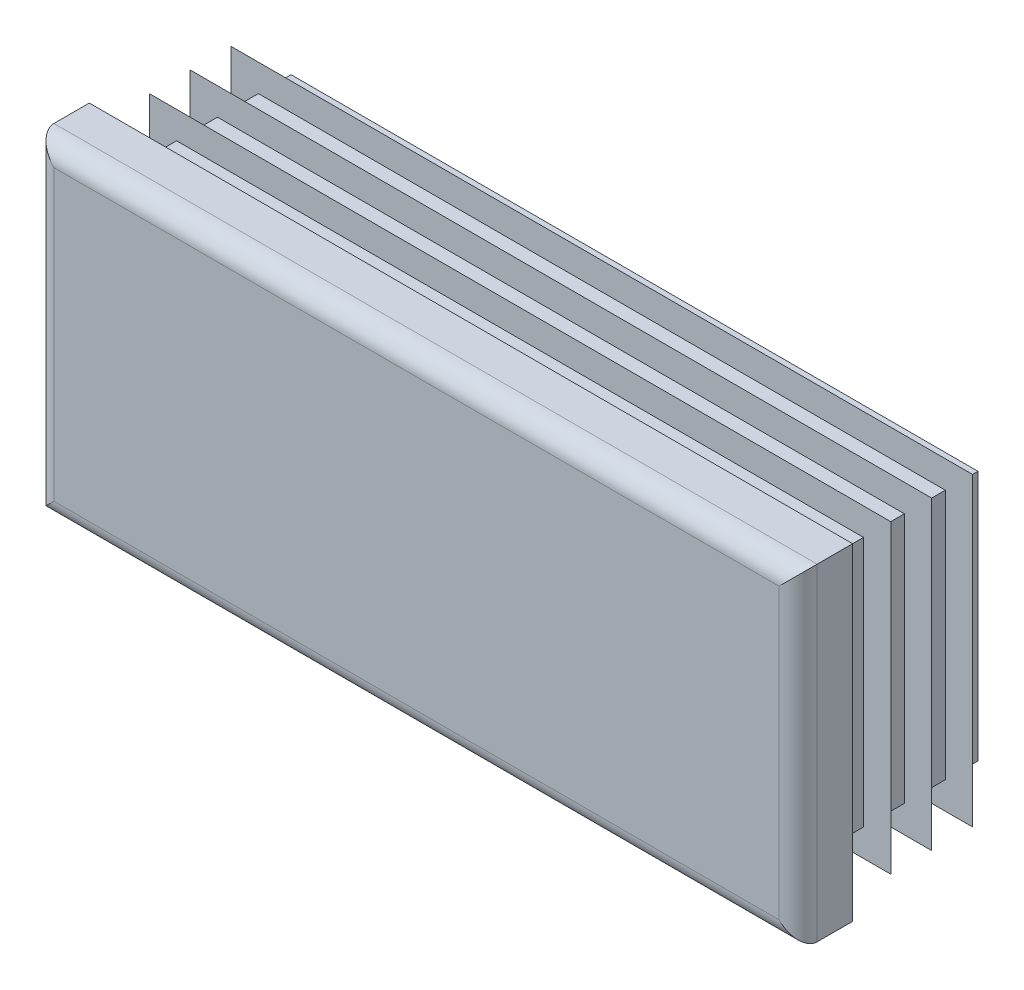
ISO-10303-21;
HEADER;
FILE_DESCRIPTION(('STEP AP214'),'2;1');
FILE_NAME('part.step','',(''),(''),'','','');
FILE_SCHEMA(('AUTOMOTIVE_DESIGN { 1 0 10303 214 1 1 1 1 }'));
ENDSEC;
DATA;
#1=APPLICATION_CONTEXT('core data for automotive mechanical design processes');
#2=APPLICATION_PROTOCOL_DEFINITION('international standard','automotive_design',2000,#1);
#3=PRODUCT_CONTEXT('',#1,'mechanical');
#4=PRODUCT('Part','Part','',(#3));
#5=PRODUCT_RELATED_PRODUCT_CATEGORY('part','',(#4));
#6=PRODUCT_DEFINITION_FORMATION('','',#4);
#7=PRODUCT_DEFINITION_CONTEXT('part definition',#1,'design');
#8=PRODUCT_DEFINITION('design','',#6,#7);
#9=PRODUCT_DEFINITION_SHAPE('','',#8);
#10=(LENGTH_UNIT() NAMED_UNIT(*) SI_UNIT(.MILLI.,.METRE.));
#11=(NAMED_UNIT(*) PLANE_ANGLE_UNIT() SI_UNIT($,.RADIAN.));
#12=(NAMED_UNIT(*) SI_UNIT($,.STERADIAN.) SOLID_ANGLE_UNIT());
#13=UNCERTAINTY_MEASURE_WITH_UNIT(LENGTH_MEASURE(1.E-05),#10,'distance_accuracy_value','');
#14=(GEOMETRIC_REPRESENTATION_CONTEXT(3) GLOBAL_UNCERTAINTY_ASSIGNED_CONTEXT((#13)) GLOBAL_UNIT_ASSIGNED_CONTEXT((#10,
#11,#12)) REPRESENTATION_CONTEXT('',''));
#15=CARTESIAN_POINT('',(0.,0.,0.));
#16=DIRECTION('',(0.,0.,1.));
#17=DIRECTION('',(1.,0.,0.));
#18=AXIS2_PLACEMENT_3D('',#15,#16,#17);
#19=CARTESIAN_POINT('',(33.25,-15.,5.));
#20=DIRECTION('',(0.,0.,-1.));
#21=DIRECTION('',(0.,1.,0.));
#22=AXIS2_PLACEMENT_3D('',#19,#20,#21);
#23=PLANE('',#22);
#24=DIRECTION('',(0.,1.,0.));
#25=VECTOR('',#24,1.);
#26=CARTESIAN_POINT('',(-33.25,-15.,5.));
#27=LINE('',#26,#25);
#28=CARTESIAN_POINT('',(-33.25,-13.25,5.));
#29=VERTEX_POINT('',#28);
#30=CARTESIAN_POINT('',(-33.25,13.25,5.));
#31=VERTEX_POINT('',#30);
#32=EDGE_CURVE('E310',#29,#31,#27,.T.);
#33=ORIENTED_EDGE('',*,*,#32,.F.);
#34=DIRECTION('',(-1.,0.,0.));
#35=VECTOR('',#34,1.);
#36=CARTESIAN_POINT('',(35.,-13.25,5.));
#37=LINE('',#36,#35);
#38=CARTESIAN_POINT('',(33.25,-13.25,5.));
#39=VERTEX_POINT('',#38);
#40=EDGE_CURVE('E482',#39,#29,#37,.T.);
#41=ORIENTED_EDGE('',*,*,#40,.F.);
#42=DIRECTION('',(0.,1.,0.));
#43=VECTOR('',#42,1.);
#44=CARTESIAN_POINT('',(33.25,-15.,5.));
#45=LINE('',#44,#43);
#46=CARTESIAN_POINT('',(33.25,13.25,5.));
#47=VERTEX_POINT('',#46);
#48=EDGE_CURVE('E305',#39,#47,#45,.T.);
#49=ORIENTED_EDGE('',*,*,#48,.T.);
#50=DIRECTION('',(-1.,0.,0.));
#51=VECTOR('',#50,1.);
#52=CARTESIAN_POINT('',(35.,13.25,5.));
#53=LINE('',#52,#51);
#54=EDGE_CURVE('E630',#47,#31,#53,.T.);
#55=ORIENTED_EDGE('',*,*,#54,.T.);
#56=EDGE_LOOP('',(#33,#41,#49,#55));
#57=FACE_BOUND('',#56,.T.);
#58=ADVANCED_FACE('F14',(#57),#23,.F.);
#59=CARTESIAN_POINT('',(-33.25,-15.,3.25));
#60=DIRECTION('',(0.,1.,0.));
#61=DIRECTION('',(-1.,0.,0.));
#62=AXIS2_PLACEMENT_3D('',#59,#60,#61);
#63=CYLINDRICAL_SURFACE('',#62,1.75);
#64=DIRECTION('',(0.,1.,0.));
#65=VECTOR('',#64,1.);
#66=CARTESIAN_POINT('',(-35.,-15.,3.25));
#67=LINE('',#66,#65);
#68=CARTESIAN_POINT('',(-35.,-15.,3.25));
#69=VERTEX_POINT('',#68);
#70=CARTESIAN_POINT('',(-35.,15.,3.25));
#71=VERTEX_POINT('',#70);
#72=EDGE_CURVE('E402',#69,#71,#67,.T.);
#73=ORIENTED_EDGE('',*,*,#72,.F.);
#74=CARTESIAN_POINT('',(-33.25,-13.25,3.25));
#75=DIRECTION('',(-0.707106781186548,0.707106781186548,0.));
#76=DIRECTION('',(0.707106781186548,0.707106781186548,0.));
#77=AXIS2_PLACEMENT_3D('',#74,#75,#76);
#78=ELLIPSE('',#77,2.47487373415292,1.75);
#79=EDGE_CURVE('E59',#69,#29,#78,.T.);
#80=ORIENTED_EDGE('',*,*,#79,.T.);
#81=ORIENTED_EDGE('',*,*,#32,.T.);
#82=CARTESIAN_POINT('',(-33.25,13.25,3.25));
#83=DIRECTION('',(0.707106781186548,0.707106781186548,0.));
#84=DIRECTION('',(-0.707106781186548,0.707106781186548,0.));
#85=AXIS2_PLACEMENT_3D('',#82,#83,#84);
#86=ELLIPSE('',#85,2.47487373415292,1.75);
#87=EDGE_CURVE('E306',#31,#71,#86,.F.);
#88=ORIENTED_EDGE('',*,*,#87,.T.);
#89=EDGE_LOOP('',(#73,#80,#81,#88));
#90=FACE_BOUND('',#89,.T.);
#91=ADVANCED_FACE('F16',(#90),#63,.T.);
#92=CARTESIAN_POINT('',(-35.,-15.,3.25));
#93=DIRECTION('',(1.,0.,0.));
#94=DIRECTION('',(0.,1.,0.));
#95=AXIS2_PLACEMENT_3D('',#92,#93,#94);
#96=PLANE('',#95);
#97=DIRECTION('',(0.,0.,-1.));
#98=VECTOR('',#97,1.);
#99=CARTESIAN_POINT('',(-35.,15.,3.25));
#100=LINE('',#99,#98);
#101=CARTESIAN_POINT('',(-35.,15.,0.));
#102=VERTEX_POINT('',#101);
#103=EDGE_CURVE('E615',#71,#102,#100,.T.);
#104=ORIENTED_EDGE('',*,*,#103,.T.);
#105=DIRECTION('',(0.,1.,0.));
#106=VECTOR('',#105,1.);
#107=CARTESIAN_POINT('',(-35.,-15.,0.));
#108=LINE('',#107,#106);
#109=CARTESIAN_POINT('',(-35.,-15.,0.));
#110=VERTEX_POINT('',#109);
#111=EDGE_CURVE('E400',#110,#102,#108,.T.);
#112=ORIENTED_EDGE('',*,*,#111,.F.);
#113=DIRECTION('',(0.,0.,-1.));
#114=VECTOR('',#113,1.);
#115=CARTESIAN_POINT('',(-35.,-15.,3.25));
#116=LINE('',#115,#114);
#117=EDGE_CURVE('E616',#69,#110,#116,.T.);
#118=ORIENTED_EDGE('',*,*,#117,.F.);
#119=ORIENTED_EDGE('',*,*,#72,.T.);
#120=EDGE_LOOP('',(#104,#112,#118,#119));
#121=FACE_BOUND('',#120,.T.);
#122=ADVANCED_FACE('F697',(#121),#96,.F.);
#123=CARTESIAN_POINT('',(-31.5,-15.,0.));
#124=DIRECTION('',(1.,0.,0.));
#125=DIRECTION('',(0.,1.,0.));
#126=AXIS2_PLACEMENT_3D('',#123,#124,#125);
#127=PLANE('',#126);
#128=DIRECTION('',(0.,1.,0.));
#129=VECTOR('',#128,1.);
#130=CARTESIAN_POINT('',(-31.5,-15.,0.));
#131=LINE('',#130,#129);
#132=CARTESIAN_POINT('',(-31.5,-11.5,0.));
#133=VERTEX_POINT('',#132);
#134=CARTESIAN_POINT('',(-31.5,11.5,0.));
#135=VERTEX_POINT('',#134);
#136=EDGE_CURVE('E397',#133,#135,#131,.T.);
#137=ORIENTED_EDGE('',*,*,#136,.T.);
#138=DIRECTION('',(0.,0.,-1.));
#139=VECTOR('',#138,1.);
#140=CARTESIAN_POINT('',(-31.5,11.5,0.));
#141=LINE('',#140,#139);
#142=CARTESIAN_POINT('',(-31.5,11.5,-0.75));
#143=VERTEX_POINT('',#142);
#144=EDGE_CURVE('E495',#135,#143,#141,.T.);
#145=ORIENTED_EDGE('',*,*,#144,.T.);
#146=DIRECTION('',(0.,1.,0.));
#147=VECTOR('',#146,1.);
#148=CARTESIAN_POINT('',(-31.5,-15.,-0.75));
#149=LINE('',#148,#147);
#150=CARTESIAN_POINT('',(-31.5,-11.5,-0.75));
#151=VERTEX_POINT('',#150);
#152=EDGE_CURVE('E394',#151,#143,#149,.T.);
#153=ORIENTED_EDGE('',*,*,#152,.F.);
#154=DIRECTION('',(0.,0.,1.));
#155=VECTOR('',#154,1.);
#156=CARTESIAN_POINT('',(-31.5,-11.5,0.));
#157=LINE('',#156,#155);
#158=EDGE_CURVE('E489',#151,#133,#157,.T.);
#159=ORIENTED_EDGE('',*,*,#158,.T.);
#160=EDGE_LOOP('',(#137,#145,#153,#159));
#161=FACE_BOUND('',#160,.T.);
#162=ADVANCED_FACE('F787',(#161),#127,.F.);
#163=CARTESIAN_POINT('',(-34.,-15.,-0.75));
#164=DIRECTION('',(0.342020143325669,0.,0.939692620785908));
#165=DIRECTION('',(-0.939692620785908,0.,0.342020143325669));
#166=AXIS2_PLACEMENT_3D('',#163,#164,#165);
#167=PLANE('',#166);
#168=DIRECTION('',(0.,1.,0.));
#169=VECTOR('',#168,1.);
#170=CARTESIAN_POINT('',(-34.,-15.,-0.75));
#171=LINE('',#170,#169);
#172=CARTESIAN_POINT('',(-34.,-14.,-0.75));
#173=VERTEX_POINT('',#172);
#174=CARTESIAN_POINT('',(-34.,14.,-0.75));
#175=VERTEX_POINT('',#174);
#176=EDGE_CURVE('E392',#173,#175,#171,.T.);
#177=ORIENTED_EDGE('',*,*,#176,.T.);
#178=DIRECTION('',(0.844349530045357,-0.438895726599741,-0.307318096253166));
#179=VECTOR('',#178,1.);
#180=CARTESIAN_POINT('',(-23.2531393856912,8.41374569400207,-4.6615373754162));
#181=LINE('',#180,#179);
#182=CARTESIAN_POINT('',(-31.5,12.7004915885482,-1.65992558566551));
#183=VERTEX_POINT('',#182);
#184=EDGE_CURVE('E519',#175,#183,#181,.T.);
#185=ORIENTED_EDGE('',*,*,#184,.T.);
#186=DIRECTION('',(0.,1.,0.));
#187=VECTOR('',#186,1.);
#188=CARTESIAN_POINT('',(-31.5,-15.,-1.65992558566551));
#189=LINE('',#188,#187);
#190=CARTESIAN_POINT('',(-31.5,-12.7004915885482,-1.65992558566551));
#191=VERTEX_POINT('',#190);
#192=EDGE_CURVE('E389',#191,#183,#189,.T.);
#193=ORIENTED_EDGE('',*,*,#192,.F.);
#194=DIRECTION('',(-0.844349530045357,-0.438895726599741,0.307318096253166));
#195=VECTOR('',#194,1.);
#196=CARTESIAN_POINT('',(-34.3705814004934,-14.1926294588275,-0.615119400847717));
#197=LINE('',#196,#195);
#198=EDGE_CURVE('E507',#191,#173,#197,.T.);
#199=ORIENTED_EDGE('',*,*,#198,.T.);
#200=EDGE_LOOP('',(#177,#185,#193,#199));
#201=FACE_BOUND('',#200,.T.);
#202=ADVANCED_FACE('F783',(#201),#167,.F.);
#203=CARTESIAN_POINT('',(-31.5,-15.,-1.65992558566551));
#204=DIRECTION('',(1.,0.,0.));
#205=DIRECTION('',(0.,1.,0.));
#206=AXIS2_PLACEMENT_3D('',#203,#204,#205);
#207=PLANE('',#206);
#208=ORIENTED_EDGE('',*,*,#192,.T.);
#209=DIRECTION('',(0.,-0.819152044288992,-0.573576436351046));
#210=VECTOR('',#209,1.);
#211=CARTESIAN_POINT('',(-31.5,-5.88681725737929,-14.6748993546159));
#212=LINE('',#211,#210);
#213=CARTESIAN_POINT('',(-31.5,11.5,-2.50051884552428));
#214=VERTEX_POINT('',#213);
#215=EDGE_CURVE('E516',#183,#214,#212,.T.);
#216=ORIENTED_EDGE('',*,*,#215,.T.);
#217=DIRECTION('',(0.,0.,-1.));
#218=VECTOR('',#217,1.);
#219=CARTESIAN_POINT('',(-31.5,11.5,-1.65992558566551));
#220=LINE('',#219,#218);
#221=CARTESIAN_POINT('',(-31.5,11.5,-4.5));
#222=VERTEX_POINT('',#221);
#223=EDGE_CURVE('E525',#214,#222,#220,.T.);
#224=ORIENTED_EDGE('',*,*,#223,.T.);
#225=DIRECTION('',(0.,1.,0.));
#226=VECTOR('',#225,1.);
#227=CARTESIAN_POINT('',(-31.5,-15.,-4.5));
#228=LINE('',#227,#226);
#229=CARTESIAN_POINT('',(-31.5,-11.5,-4.5));
#230=VERTEX_POINT('',#229);
#231=EDGE_CURVE('E386',#230,#222,#228,.T.);
#232=ORIENTED_EDGE('',*,*,#231,.F.);
#233=DIRECTION('',(0.,0.,1.));
#234=VECTOR('',#233,1.);
#235=CARTESIAN_POINT('',(-31.5,-11.5,-1.65992558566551));
#236=LINE('',#235,#234);
#237=CARTESIAN_POINT('',(-31.5,-11.5,-2.50051884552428));
#238=VERTEX_POINT('',#237);
#239=EDGE_CURVE('E522',#230,#238,#236,.T.);
#240=ORIENTED_EDGE('',*,*,#239,.T.);
#241=DIRECTION('',(0.,-0.819152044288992,0.573576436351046));
#242=VECTOR('',#241,1.);
#243=CARTESIAN_POINT('',(-31.5,-14.2434848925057,-0.579510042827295));
#244=LINE('',#243,#242);
#245=EDGE_CURVE('E504',#238,#191,#244,.T.);
#246=ORIENTED_EDGE('',*,*,#245,.T.);
#247=EDGE_LOOP('',(#208,#216,#224,#232,#240,#246));
#248=FACE_BOUND('',#247,.T.);
#249=ADVANCED_FACE('F779',(#248),#207,.F.);
#250=CARTESIAN_POINT('',(-34.,-15.,-4.5));
#251=DIRECTION('',(0.342020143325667,0.,0.939692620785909));
#252=DIRECTION('',(-0.939692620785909,0.,0.342020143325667));
#253=AXIS2_PLACEMENT_3D('',#250,#251,#252);
#254=PLANE('',#253);
#255=DIRECTION('',(0.,1.,0.));
#256=VECTOR('',#255,1.);
#257=CARTESIAN_POINT('',(-34.,-15.,-4.5));
#258=LINE('',#257,#256);
#259=CARTESIAN_POINT('',(-34.,-14.,-4.5));
#260=VERTEX_POINT('',#259);
#261=CARTESIAN_POINT('',(-34.,14.,-4.5));
#262=VERTEX_POINT('',#261);
#263=EDGE_CURVE('E384',#260,#262,#258,.T.);
#264=ORIENTED_EDGE('',*,*,#263,.T.);
#265=DIRECTION('',(0.844349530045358,-0.43889572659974,-0.307318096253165));
#266=VECTOR('',#265,1.);
#267=CARTESIAN_POINT('',(-23.2531393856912,8.4137456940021,-8.41153737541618));
#268=LINE('',#267,#266);
#269=CARTESIAN_POINT('',(-31.5,12.7004915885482,-5.4099255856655));
#270=VERTEX_POINT('',#269);
#271=EDGE_CURVE('E549',#262,#270,#268,.T.);
#272=ORIENTED_EDGE('',*,*,#271,.T.);
#273=DIRECTION('',(0.,1.,0.));
#274=VECTOR('',#273,1.);
#275=CARTESIAN_POINT('',(-31.5,-15.,-5.4099255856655));
#276=LINE('',#275,#274);
#277=CARTESIAN_POINT('',(-31.5,-12.7004915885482,-5.4099255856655));
#278=VERTEX_POINT('',#277);
#279=EDGE_CURVE('E381',#278,#270,#276,.T.);
#280=ORIENTED_EDGE('',*,*,#279,.F.);
#281=DIRECTION('',(-0.844349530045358,-0.438895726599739,0.307318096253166));
#282=VECTOR('',#281,1.);
#283=CARTESIAN_POINT('',(-34.3705814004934,-14.1926294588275,-4.36511940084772));
#284=LINE('',#283,#282);
#285=EDGE_CURVE('E537',#278,#260,#284,.T.);
#286=ORIENTED_EDGE('',*,*,#285,.T.);
#287=EDGE_LOOP('',(#264,#272,#280,#286));
#288=FACE_BOUND('',#287,.T.);
#289=ADVANCED_FACE('F775',(#288),#254,.F.);
#290=CARTESIAN_POINT('',(-31.5,-15.,-5.4099255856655));
#291=DIRECTION('',(1.,0.,0.));
#292=DIRECTION('',(0.,1.,0.));
#293=AXIS2_PLACEMENT_3D('',#290,#291,#292);
#294=PLANE('',#293);
#295=ORIENTED_EDGE('',*,*,#279,.T.);
#296=DIRECTION('',(0.,-0.819152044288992,-0.573576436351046));
#297=VECTOR('',#296,1.);
#298=CARTESIAN_POINT('',(-31.5,-5.88681725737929,-18.4248993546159));
#299=LINE('',#298,#297);
#300=CARTESIAN_POINT('',(-31.5,11.5,-6.25051884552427));
#301=VERTEX_POINT('',#300);
#302=EDGE_CURVE('E546',#270,#301,#299,.T.);
#303=ORIENTED_EDGE('',*,*,#302,.T.);
#304=DIRECTION('',(0.,0.,-1.));
#305=VECTOR('',#304,1.);
#306=CARTESIAN_POINT('',(-31.5,11.5,-5.4099255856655));
#307=LINE('',#306,#305);
#308=CARTESIAN_POINT('',(-31.5,11.5,-8.25));
#309=VERTEX_POINT('',#308);
#310=EDGE_CURVE('E555',#301,#309,#307,.T.);
#311=ORIENTED_EDGE('',*,*,#310,.T.);
#312=DIRECTION('',(0.,1.,0.));
#313=VECTOR('',#312,1.);
#314=CARTESIAN_POINT('',(-31.5,-15.,-8.25));
#315=LINE('',#314,#313);
#316=CARTESIAN_POINT('',(-31.5,-11.5,-8.25));
#317=VERTEX_POINT('',#316);
#318=EDGE_CURVE('E378',#317,#309,#315,.T.);
#319=ORIENTED_EDGE('',*,*,#318,.F.);
#320=DIRECTION('',(0.,0.,1.));
#321=VECTOR('',#320,1.);
#322=CARTESIAN_POINT('',(-31.5,-11.5,-5.4099255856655));
#323=LINE('',#322,#321);
#324=CARTESIAN_POINT('',(-31.5,-11.5,-6.25051884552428));
#325=VERTEX_POINT('',#324);
#326=EDGE_CURVE('E552',#317,#325,#323,.T.);
#327=ORIENTED_EDGE('',*,*,#326,.T.);
#328=DIRECTION('',(0.,-0.819152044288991,0.573576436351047));
#329=VECTOR('',#328,1.);
#330=CARTESIAN_POINT('',(-31.5,-14.2434848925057,-4.32951004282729));
#331=LINE('',#330,#329);
#332=EDGE_CURVE('E534',#325,#278,#331,.T.);
#333=ORIENTED_EDGE('',*,*,#332,.T.);
#334=EDGE_LOOP('',(#295,#303,#311,#319,#327,#333));
#335=FACE_BOUND('',#334,.T.);
#336=ADVANCED_FACE('F771',(#335),#294,.F.);
#337=CARTESIAN_POINT('',(-34.,-15.,-8.25));
#338=DIRECTION('',(0.342020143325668,0.,0.939692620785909));
#339=DIRECTION('',(-0.939692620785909,0.,0.342020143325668));
#340=AXIS2_PLACEMENT_3D('',#337,#338,#339);
#341=PLANE('',#340);
#342=DIRECTION('',(0.,1.,0.));
#343=VECTOR('',#342,1.);
#344=CARTESIAN_POINT('',(-34.,-15.,-8.25));
#345=LINE('',#344,#343);
#346=CARTESIAN_POINT('',(-34.,-14.,-8.25));
#347=VERTEX_POINT('',#346);
#348=CARTESIAN_POINT('',(-34.,14.,-8.25));
#349=VERTEX_POINT('',#348);
#350=EDGE_CURVE('E376',#347,#349,#345,.T.);
#351=ORIENTED_EDGE('',*,*,#350,.T.);
#352=DIRECTION('',(0.844349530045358,-0.43889572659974,-0.307318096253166));
#353=VECTOR('',#352,1.);
#354=CARTESIAN_POINT('',(-23.2531393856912,8.41374569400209,-12.1615373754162));
#355=LINE('',#354,#353);
#356=CARTESIAN_POINT('',(-31.5,12.7004915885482,-9.15992558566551));
#357=VERTEX_POINT('',#356);
#358=EDGE_CURVE('E579',#349,#357,#355,.T.);
#359=ORIENTED_EDGE('',*,*,#358,.T.);
#360=DIRECTION('',(0.,1.,0.));
#361=VECTOR('',#360,1.);
#362=CARTESIAN_POINT('',(-31.5,-15.,-9.1599255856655));
#363=LINE('',#362,#361);
#364=CARTESIAN_POINT('',(-31.5,-12.7004915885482,-9.1599255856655));
#365=VERTEX_POINT('',#364);
#366=EDGE_CURVE('E373',#365,#357,#363,.T.);
#367=ORIENTED_EDGE('',*,*,#366,.F.);
#368=DIRECTION('',(-0.844349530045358,-0.43889572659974,0.307318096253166));
#369=VECTOR('',#368,1.);
#370=CARTESIAN_POINT('',(-34.3705814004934,-14.1926294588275,-8.11511940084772));
#371=LINE('',#370,#369);
#372=EDGE_CURVE('E567',#365,#347,#371,.T.);
#373=ORIENTED_EDGE('',*,*,#372,.T.);
#374=EDGE_LOOP('',(#351,#359,#367,#373));
#375=FACE_BOUND('',#374,.T.);
#376=ADVANCED_FACE('F767',(#375),#341,.F.);
#377=CARTESIAN_POINT('',(-31.5,-15.,-9.1599255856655));
#378=DIRECTION('',(1.,0.,0.));
#379=DIRECTION('',(0.,1.,0.));
#380=AXIS2_PLACEMENT_3D('',#377,#378,#379);
#381=PLANE('',#380);
#382=ORIENTED_EDGE('',*,*,#366,.T.);
#383=DIRECTION('',(0.,-0.819152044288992,-0.573576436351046));
#384=VECTOR('',#383,1.);
#385=CARTESIAN_POINT('',(-31.5,-5.88681725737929,-22.1748993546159));
#386=LINE('',#385,#384);
#387=CARTESIAN_POINT('',(-31.5,11.5,-10.0005188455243));
#388=VERTEX_POINT('',#387);
#389=EDGE_CURVE('E576',#357,#388,#386,.T.);
#390=ORIENTED_EDGE('',*,*,#389,.T.);
#391=DIRECTION('',(0.,0.,-1.));
#392=VECTOR('',#391,1.);
#393=CARTESIAN_POINT('',(-31.5,11.5,-9.1599255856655));
#394=LINE('',#393,#392);
#395=CARTESIAN_POINT('',(-31.5,11.5,-12.));
#396=VERTEX_POINT('',#395);
#397=EDGE_CURVE('E585',#388,#396,#394,.T.);
#398=ORIENTED_EDGE('',*,*,#397,.T.);
#399=DIRECTION('',(0.,1.,0.));
#400=VECTOR('',#399,1.);
#401=CARTESIAN_POINT('',(-31.5,-15.,-12.));
#402=LINE('',#401,#400);
#403=CARTESIAN_POINT('',(-31.5,-11.5,-12.));
#404=VERTEX_POINT('',#403);
#405=EDGE_CURVE('E370',#404,#396,#402,.T.);
#406=ORIENTED_EDGE('',*,*,#405,.F.);
#407=DIRECTION('',(0.,0.,1.));
#408=VECTOR('',#407,1.);
#409=CARTESIAN_POINT('',(-31.5,-11.5,-9.1599255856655));
#410=LINE('',#409,#408);
#411=CARTESIAN_POINT('',(-31.5,-11.5,-10.0005188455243));
#412=VERTEX_POINT('',#411);
#413=EDGE_CURVE('E582',#404,#412,#410,.T.);
#414=ORIENTED_EDGE('',*,*,#413,.T.);
#415=DIRECTION('',(0.,-0.819152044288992,0.573576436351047));
#416=VECTOR('',#415,1.);
#417=CARTESIAN_POINT('',(-31.5,-14.2434848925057,-8.0795100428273));
#418=LINE('',#417,#416);
#419=EDGE_CURVE('E564',#412,#365,#418,.T.);
#420=ORIENTED_EDGE('',*,*,#419,.T.);
#421=EDGE_LOOP('',(#382,#390,#398,#406,#414,#420));
#422=FACE_BOUND('',#421,.T.);
#423=ADVANCED_FACE('F764',(#422),#381,.F.);
#424=CARTESIAN_POINT('',(-34.,-15.,-12.));
#425=DIRECTION('',(0.342020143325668,0.,0.939692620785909));
#426=DIRECTION('',(-0.939692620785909,0.,0.342020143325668));
#427=AXIS2_PLACEMENT_3D('',#424,#425,#426);
#428=PLANE('',#427);
#429=DIRECTION('',(0.,1.,0.));
#430=VECTOR('',#429,1.);
#431=CARTESIAN_POINT('',(-34.,-15.,-12.));
#432=LINE('',#431,#430);
#433=CARTESIAN_POINT('',(-34.,-14.,-12.));
#434=VERTEX_POINT('',#433);
#435=CARTESIAN_POINT('',(-34.,14.,-12.));
#436=VERTEX_POINT('',#435);
#437=EDGE_CURVE('E368',#434,#436,#432,.T.);
#438=ORIENTED_EDGE('',*,*,#437,.T.);
#439=DIRECTION('',(0.844349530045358,-0.43889572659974,-0.307318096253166));
#440=VECTOR('',#439,1.);
#441=CARTESIAN_POINT('',(-23.2531393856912,8.41374569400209,-15.9115373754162));
#442=LINE('',#441,#440);
#443=CARTESIAN_POINT('',(-31.5,12.7004915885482,-12.9099255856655));
#444=VERTEX_POINT('',#443);
#445=EDGE_CURVE('E607',#436,#444,#442,.T.);
#446=ORIENTED_EDGE('',*,*,#445,.T.);
#447=DIRECTION('',(0.,1.,0.));
#448=VECTOR('',#447,1.);
#449=CARTESIAN_POINT('',(-31.5,-15.,-12.9099255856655));
#450=LINE('',#449,#448);
#451=CARTESIAN_POINT('',(-31.5,-12.7004915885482,-12.9099255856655));
#452=VERTEX_POINT('',#451);
#453=EDGE_CURVE('E365',#452,#444,#450,.T.);
#454=ORIENTED_EDGE('',*,*,#453,.F.);
#455=DIRECTION('',(-0.844349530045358,-0.438895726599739,0.307318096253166));
#456=VECTOR('',#455,1.);
#457=CARTESIAN_POINT('',(-34.3705814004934,-14.1926294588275,-11.8651194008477));
#458=LINE('',#457,#456);
#459=EDGE_CURVE('E595',#452,#434,#458,.T.);
#460=ORIENTED_EDGE('',*,*,#459,.T.);
#461=EDGE_LOOP('',(#438,#446,#454,#460));
#462=FACE_BOUND('',#461,.T.);
#463=ADVANCED_FACE('F675',(#462),#428,.F.);
#464=CARTESIAN_POINT('',(-31.5,-15.,-12.9099255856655));
#465=DIRECTION('',(1.,0.,0.));
#466=DIRECTION('',(0.,1.,0.));
#467=AXIS2_PLACEMENT_3D('',#464,#465,#466);
#468=PLANE('',#467);
#469=ORIENTED_EDGE('',*,*,#453,.T.);
#470=DIRECTION('',(0.,-0.819152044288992,-0.573576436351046));
#471=VECTOR('',#470,1.);
#472=CARTESIAN_POINT('',(-31.5,-5.88681725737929,-25.9248993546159));
#473=LINE('',#472,#471);
#474=CARTESIAN_POINT('',(-31.5,11.5,-13.7505188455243));
#475=VERTEX_POINT('',#474);
#476=EDGE_CURVE('E604',#444,#475,#473,.T.);
#477=ORIENTED_EDGE('',*,*,#476,.T.);
#478=DIRECTION('',(0.,0.,-1.));
#479=VECTOR('',#478,1.);
#480=CARTESIAN_POINT('',(-31.5,11.5,-12.9099255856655));
#481=LINE('',#480,#479);
#482=CARTESIAN_POINT('',(-31.5,11.5,-15.));
#483=VERTEX_POINT('',#482);
#484=EDGE_CURVE('E613',#475,#483,#481,.T.);
#485=ORIENTED_EDGE('',*,*,#484,.T.);
#486=DIRECTION('',(0.,1.,0.));
#487=VECTOR('',#486,1.);
#488=CARTESIAN_POINT('',(-31.5,-15.,-15.));
#489=LINE('',#488,#487);
#490=CARTESIAN_POINT('',(-31.5,-11.5,-15.));
#491=VERTEX_POINT('',#490);
#492=EDGE_CURVE('E362',#491,#483,#489,.T.);
#493=ORIENTED_EDGE('',*,*,#492,.F.);
#494=DIRECTION('',(0.,0.,1.));
#495=VECTOR('',#494,1.);
#496=CARTESIAN_POINT('',(-31.5,-11.5,-12.9099255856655));
#497=LINE('',#496,#495);
#498=CARTESIAN_POINT('',(-31.5,-11.5,-13.7505188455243));
#499=VERTEX_POINT('',#498);
#500=EDGE_CURVE('E610',#491,#499,#497,.T.);
#501=ORIENTED_EDGE('',*,*,#500,.T.);
#502=DIRECTION('',(0.,-0.819152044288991,0.573576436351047));
#503=VECTOR('',#502,1.);
#504=CARTESIAN_POINT('',(-31.5,-14.2434848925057,-11.8295100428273));
#505=LINE('',#504,#503);
#506=EDGE_CURVE('E592',#499,#452,#505,.T.);
#507=ORIENTED_EDGE('',*,*,#506,.T.);
#508=EDGE_LOOP('',(#469,#477,#485,#493,#501,#507));
#509=FACE_BOUND('',#508,.T.);
#510=ADVANCED_FACE('F677',(#509),#468,.F.);
#511=CARTESIAN_POINT('',(-31.5,-15.,-15.));
#512=DIRECTION('',(0.,0.,1.));
#513=DIRECTION('',(0.,-1.,0.));
#514=AXIS2_PLACEMENT_3D('',#511,#512,#513);
#515=PLANE('',#514);
#516=ORIENTED_EDGE('',*,*,#492,.T.);
#517=DIRECTION('',(-1.,0.,0.));
#518=VECTOR('',#517,1.);
#519=CARTESIAN_POINT('',(35.,11.5,-15.));
#520=LINE('',#519,#518);
#521=CARTESIAN_POINT('',(31.5,11.5,-15.));
#522=VERTEX_POINT('',#521);
#523=EDGE_CURVE('E438',#522,#483,#520,.T.);
#524=ORIENTED_EDGE('',*,*,#523,.F.);
#525=DIRECTION('',(0.,1.,0.));
#526=VECTOR('',#525,1.);
#527=CARTESIAN_POINT('',(31.5,-15.,-15.));
#528=LINE('',#527,#526);
#529=CARTESIAN_POINT('',(31.5,-11.5,-15.));
#530=VERTEX_POINT('',#529);
#531=EDGE_CURVE('E359',#530,#522,#528,.T.);
#532=ORIENTED_EDGE('',*,*,#531,.F.);
#533=DIRECTION('',(-1.,0.,0.));
#534=VECTOR('',#533,1.);
#535=CARTESIAN_POINT('',(35.,-11.5,-15.));
#536=LINE('',#535,#534);
#537=EDGE_CURVE('E436',#530,#491,#536,.T.);
#538=ORIENTED_EDGE('',*,*,#537,.T.);
#539=EDGE_LOOP('',(#516,#524,#532,#538));
#540=FACE_BOUND('',#539,.T.);
#541=ADVANCED_FACE('F435',(#540),#515,.F.);
#542=CARTESIAN_POINT('',(31.5,-15.,-15.));
#543=DIRECTION('',(-1.,0.,0.));
#544=DIRECTION('',(0.,-1.,0.));
#545=AXIS2_PLACEMENT_3D('',#542,#543,#544);
#546=PLANE('',#545);
#547=DIRECTION('',(0.,0.,1.));
#548=VECTOR('',#547,1.);
#549=CARTESIAN_POINT('',(31.5,11.5,-15.));
#550=LINE('',#549,#548);
#551=CARTESIAN_POINT('',(31.5,11.5,-13.7505188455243));
#552=VERTEX_POINT('',#551);
#553=EDGE_CURVE('E9',#522,#552,#550,.T.);
#554=ORIENTED_EDGE('',*,*,#553,.T.);
#555=DIRECTION('',(0.,0.819152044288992,0.573576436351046));
#556=VECTOR('',#555,1.);
#557=CARTESIAN_POINT('',(31.5,-6.86883100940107,-26.6125127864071));
#558=LINE('',#557,#556);
#559=CARTESIAN_POINT('',(31.5,12.7004915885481,-12.9099255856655));
#560=VERTEX_POINT('',#559);
#561=EDGE_CURVE('E601',#552,#560,#558,.T.);
#562=ORIENTED_EDGE('',*,*,#561,.T.);
#563=DIRECTION('',(0.,1.,0.));
#564=VECTOR('',#563,1.);
#565=CARTESIAN_POINT('',(31.5,-15.,-12.9099255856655));
#566=LINE('',#565,#564);
#567=CARTESIAN_POINT('',(31.5,-12.7004915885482,-12.9099255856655));
#568=VERTEX_POINT('',#567);
#569=EDGE_CURVE('E356',#568,#560,#566,.T.);
#570=ORIENTED_EDGE('',*,*,#569,.F.);
#571=DIRECTION('',(0.,0.819152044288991,-0.573576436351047));
#572=VECTOR('',#571,1.);
#573=CARTESIAN_POINT('',(31.5,-13.261471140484,-12.5171234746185));
#574=LINE('',#573,#572);
#575=CARTESIAN_POINT('',(31.5,-11.5,-13.7505188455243));
#576=VERTEX_POINT('',#575);
#577=EDGE_CURVE('E428',#568,#576,#574,.T.);
#578=ORIENTED_EDGE('',*,*,#577,.T.);
#579=DIRECTION('',(0.,0.,-1.));
#580=VECTOR('',#579,1.);
#581=CARTESIAN_POINT('',(31.5,-11.5,-15.));
#582=LINE('',#581,#580);
#583=EDGE_CURVE('E23',#576,#530,#582,.T.);
#584=ORIENTED_EDGE('',*,*,#583,.T.);
#585=ORIENTED_EDGE('',*,*,#531,.T.);
#586=EDGE_LOOP('',(#554,#562,#570,#578,#584,#585));
#587=FACE_BOUND('',#586,.T.);
#588=ADVANCED_FACE('F426',(#587),#546,.F.);
#589=CARTESIAN_POINT('',(31.5,-15.,-12.9099255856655));
#590=DIRECTION('',(-0.342020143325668,0.,0.939692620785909));
#591=DIRECTION('',(-0.939692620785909,0.,-0.342020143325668));
#592=AXIS2_PLACEMENT_3D('',#589,#590,#591);
#593=PLANE('',#592);
#594=ORIENTED_EDGE('',*,*,#569,.T.);
#595=DIRECTION('',(0.844349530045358,0.43889572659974,0.307318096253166));
#596=VECTOR('',#595,1.);
#597=CARTESIAN_POINT('',(21.23471303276,7.36456088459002,-16.6461844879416));
#598=LINE('',#597,#596);
#599=CARTESIAN_POINT('',(34.,14.,-12.));
#600=VERTEX_POINT('',#599);
#601=EDGE_CURVE('E598',#560,#600,#598,.T.);
#602=ORIENTED_EDGE('',*,*,#601,.T.);
#603=DIRECTION('',(0.,1.,0.));
#604=VECTOR('',#603,1.);
#605=CARTESIAN_POINT('',(34.,-15.,-12.));
#606=LINE('',#605,#604);
#607=CARTESIAN_POINT('',(34.,-14.,-12.));
#608=VERTEX_POINT('',#607);
#609=EDGE_CURVE('E353',#608,#600,#606,.T.);
#610=ORIENTED_EDGE('',*,*,#609,.F.);
#611=DIRECTION('',(-0.844349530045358,0.438895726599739,-0.307318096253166));
#612=VECTOR('',#611,1.);
#613=CARTESIAN_POINT('',(32.3521550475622,-13.1434446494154,-12.5997665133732));
#614=LINE('',#613,#612);
#615=EDGE_CURVE('E588',#608,#568,#614,.T.);
#616=ORIENTED_EDGE('',*,*,#615,.T.);
#617=EDGE_LOOP('',(#594,#602,#610,#616));
#618=FACE_BOUND('',#617,.T.);
#619=ADVANCED_FACE('F752',(#618),#593,.F.);
#620=CARTESIAN_POINT('',(34.,-15.,-12.));
#621=DIRECTION('',(0.,0.,-1.));
#622=DIRECTION('',(0.,1.,0.));
#623=AXIS2_PLACEMENT_3D('',#620,#621,#622);
#624=PLANE('',#623);
#625=ORIENTED_EDGE('',*,*,#609,.T.);
#626=DIRECTION('',(-1.,0.,0.));
#627=VECTOR('',#626,1.);
#628=CARTESIAN_POINT('',(35.,14.,-12.));
#629=LINE('',#628,#627);
#630=EDGE_CURVE('E444',#600,#436,#629,.T.);
#631=ORIENTED_EDGE('',*,*,#630,.T.);
#632=ORIENTED_EDGE('',*,*,#437,.F.);
#633=DIRECTION('',(-1.,0.,0.));
#634=VECTOR('',#633,1.);
#635=CARTESIAN_POINT('',(35.,-14.,-12.));
#636=LINE('',#635,#634);
#637=EDGE_CURVE('E451',#608,#434,#636,.T.);
#638=ORIENTED_EDGE('',*,*,#637,.F.);
#639=EDGE_LOOP('',(#625,#631,#632,#638));
#640=FACE_BOUND('',#639,.T.);
#641=ORIENTED_EDGE('',*,*,#405,.T.);
#642=DIRECTION('',(-1.,0.,0.));
#643=VECTOR('',#642,1.);
#644=CARTESIAN_POINT('',(35.,11.5,-12.));
#645=LINE('',#644,#643);
#646=CARTESIAN_POINT('',(31.5,11.5,-12.));
#647=VERTEX_POINT('',#646);
#648=EDGE_CURVE('E663',#647,#396,#645,.T.);
#649=ORIENTED_EDGE('',*,*,#648,.F.);
#650=DIRECTION('',(0.,1.,0.));
#651=VECTOR('',#650,1.);
#652=CARTESIAN_POINT('',(31.5,-15.,-12.));
#653=LINE('',#652,#651);
#654=CARTESIAN_POINT('',(31.5,-11.5,-12.));
#655=VERTEX_POINT('',#654);
#656=EDGE_CURVE('E350',#655,#647,#653,.T.);
#657=ORIENTED_EDGE('',*,*,#656,.F.);
#658=DIRECTION('',(-1.,0.,0.));
#659=VECTOR('',#658,1.);
#660=CARTESIAN_POINT('',(35.,-11.5,-12.));
#661=LINE('',#660,#659);
#662=EDGE_CURVE('E453',#655,#404,#661,.T.);
#663=ORIENTED_EDGE('',*,*,#662,.T.);
#664=EDGE_LOOP('',(#641,#649,#657,#663));
#665=FACE_BOUND('',#664,.T.);
#666=ADVANCED_FACE('F667',(#640,#665),#624,.F.);
#667=CARTESIAN_POINT('',(31.5,-15.,-12.));
#668=DIRECTION('',(-1.,0.,0.));
#669=DIRECTION('',(0.,-1.,0.));
#670=AXIS2_PLACEMENT_3D('',#667,#668,#669);
#671=PLANE('',#670);
#672=DIRECTION('',(0.,0.,1.));
#673=VECTOR('',#672,1.);
#674=CARTESIAN_POINT('',(31.5,11.5,-12.));
#675=LINE('',#674,#673);
#676=CARTESIAN_POINT('',(31.5,11.5,-10.0005188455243));
#677=VERTEX_POINT('',#676);
#678=EDGE_CURVE('E420',#647,#677,#675,.T.);
#679=ORIENTED_EDGE('',*,*,#678,.T.);
#680=DIRECTION('',(0.,0.819152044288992,0.573576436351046));
#681=VECTOR('',#680,1.);
#682=CARTESIAN_POINT('',(31.5,-7.22121574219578,-23.1092552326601));
#683=LINE('',#682,#681);
#684=CARTESIAN_POINT('',(31.5,12.7004915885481,-9.1599255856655));
#685=VERTEX_POINT('',#684);
#686=EDGE_CURVE('E573',#677,#685,#683,.T.);
#687=ORIENTED_EDGE('',*,*,#686,.T.);
#688=DIRECTION('',(0.,1.,0.));
#689=VECTOR('',#688,1.);
#690=CARTESIAN_POINT('',(31.5,-15.,-9.1599255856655));
#691=LINE('',#690,#689);
#692=CARTESIAN_POINT('',(31.5,-12.7004915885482,-9.15992558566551));
#693=VERTEX_POINT('',#692);
#694=EDGE_CURVE('E347',#693,#685,#691,.T.);
#695=ORIENTED_EDGE('',*,*,#694,.F.);
#696=DIRECTION('',(0.,0.819152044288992,-0.573576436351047));
#697=VECTOR('',#696,1.);
#698=CARTESIAN_POINT('',(31.5,-12.9090864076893,-9.01386592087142));
#699=LINE('',#698,#697);
#700=CARTESIAN_POINT('',(31.5,-11.5,-10.0005188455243));
#701=VERTEX_POINT('',#700);
#702=EDGE_CURVE('E561',#693,#701,#699,.T.);
#703=ORIENTED_EDGE('',*,*,#702,.T.);
#704=DIRECTION('',(0.,0.,-1.));
#705=VECTOR('',#704,1.);
#706=CARTESIAN_POINT('',(31.5,-11.5,-12.));
#707=LINE('',#706,#705);
#708=EDGE_CURVE('E417',#701,#655,#707,.T.);
#709=ORIENTED_EDGE('',*,*,#708,.T.);
#710=ORIENTED_EDGE('',*,*,#656,.T.);
#711=EDGE_LOOP('',(#679,#687,#695,#703,#709,#710));
#712=FACE_BOUND('',#711,.T.);
#713=ADVANCED_FACE('F745',(#712),#671,.F.);
#714=CARTESIAN_POINT('',(31.5,-15.,-9.1599255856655));
#715=DIRECTION('',(-0.342020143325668,0.,0.939692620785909));
#716=DIRECTION('',(-0.939692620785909,0.,-0.342020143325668));
#717=AXIS2_PLACEMENT_3D('',#714,#715,#716);
#718=PLANE('',#717);
#719=ORIENTED_EDGE('',*,*,#694,.T.);
#720=DIRECTION('',(0.844349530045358,0.43889572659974,0.307318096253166));
#721=VECTOR('',#720,1.);
#722=CARTESIAN_POINT('',(21.23471303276,7.36456088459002,-12.8961844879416));
#723=LINE('',#722,#721);
#724=CARTESIAN_POINT('',(34.,14.,-8.25));
#725=VERTEX_POINT('',#724);
#726=EDGE_CURVE('E570',#685,#725,#723,.T.);
#727=ORIENTED_EDGE('',*,*,#726,.T.);
#728=DIRECTION('',(0.,1.,0.));
#729=VECTOR('',#728,1.);
#730=CARTESIAN_POINT('',(34.,-15.,-8.25));
#731=LINE('',#730,#729);
#732=CARTESIAN_POINT('',(34.,-14.,-8.25));
#733=VERTEX_POINT('',#732);
#734=EDGE_CURVE('E344',#733,#725,#731,.T.);
#735=ORIENTED_EDGE('',*,*,#734,.F.);
#736=DIRECTION('',(-0.844349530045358,0.43889572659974,-0.307318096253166));
#737=VECTOR('',#736,1.);
#738=CARTESIAN_POINT('',(32.3521550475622,-13.1434446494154,-8.84976651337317));
#739=LINE('',#738,#737);
#740=EDGE_CURVE('E558',#733,#693,#739,.T.);
#741=ORIENTED_EDGE('',*,*,#740,.T.);
#742=EDGE_LOOP('',(#719,#727,#735,#741));
#743=FACE_BOUND('',#742,.T.);
#744=ADVANCED_FACE('F741',(#743),#718,.F.);
#745=CARTESIAN_POINT('',(34.,-15.,-8.25));
#746=DIRECTION('',(0.,0.,-1.));
#747=DIRECTION('',(0.,1.,0.));
#748=AXIS2_PLACEMENT_3D('',#745,#746,#747);
#749=PLANE('',#748);
#750=ORIENTED_EDGE('',*,*,#734,.T.);
#751=DIRECTION('',(-1.,0.,0.));
#752=VECTOR('',#751,1.);
#753=CARTESIAN_POINT('',(35.,14.,-8.25));
#754=LINE('',#753,#752);
#755=EDGE_CURVE('E657',#725,#349,#754,.T.);
#756=ORIENTED_EDGE('',*,*,#755,.T.);
#757=ORIENTED_EDGE('',*,*,#350,.F.);
#758=DIRECTION('',(-1.,0.,0.));
#759=VECTOR('',#758,1.);
#760=CARTESIAN_POINT('',(35.,-14.,-8.25));
#761=LINE('',#760,#759);
#762=EDGE_CURVE('E459',#733,#347,#761,.T.);
#763=ORIENTED_EDGE('',*,*,#762,.F.);
#764=EDGE_LOOP('',(#750,#756,#757,#763));
#765=FACE_BOUND('',#764,.T.);
#766=ORIENTED_EDGE('',*,*,#318,.T.);
#767=DIRECTION('',(-1.,0.,0.));
#768=VECTOR('',#767,1.);
#769=CARTESIAN_POINT('',(35.,11.5,-8.25));
#770=LINE('',#769,#768);
#771=CARTESIAN_POINT('',(31.5,11.5,-8.25));
#772=VERTEX_POINT('',#771);
#773=EDGE_CURVE('E655',#772,#309,#770,.T.);
#774=ORIENTED_EDGE('',*,*,#773,.F.);
#775=DIRECTION('',(0.,1.,0.));
#776=VECTOR('',#775,1.);
#777=CARTESIAN_POINT('',(31.5,-15.,-8.25));
#778=LINE('',#777,#776);
#779=CARTESIAN_POINT('',(31.5,-11.5,-8.25));
#780=VERTEX_POINT('',#779);
#781=EDGE_CURVE('E341',#780,#772,#778,.T.);
#782=ORIENTED_EDGE('',*,*,#781,.F.);
#783=DIRECTION('',(-1.,0.,0.));
#784=VECTOR('',#783,1.);
#785=CARTESIAN_POINT('',(35.,-11.5,-8.25));
#786=LINE('',#785,#784);
#787=EDGE_CURVE('E461',#780,#317,#786,.T.);
#788=ORIENTED_EDGE('',*,*,#787,.T.);
#789=EDGE_LOOP('',(#766,#774,#782,#788));
#790=FACE_BOUND('',#789,.T.);
#791=ADVANCED_FACE('F737',(#765,#790),#749,.F.);
#792=CARTESIAN_POINT('',(31.5,-15.,-8.25));
#793=DIRECTION('',(-1.,0.,0.));
#794=DIRECTION('',(0.,-1.,0.));
#795=AXIS2_PLACEMENT_3D('',#792,#793,#794);
#796=PLANE('',#795);
#797=DIRECTION('',(0.,0.,1.));
#798=VECTOR('',#797,1.);
#799=CARTESIAN_POINT('',(31.5,11.5,-8.25));
#800=LINE('',#799,#798);
#801=CARTESIAN_POINT('',(31.5,11.5,-6.25051884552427));
#802=VERTEX_POINT('',#801);
#803=EDGE_CURVE('E414',#772,#802,#800,.T.);
#804=ORIENTED_EDGE('',*,*,#803,.T.);
#805=DIRECTION('',(0.,0.819152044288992,0.573576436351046));
#806=VECTOR('',#805,1.);
#807=CARTESIAN_POINT('',(31.5,-7.22121574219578,-19.3592552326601));
#808=LINE('',#807,#806);
#809=CARTESIAN_POINT('',(31.5,12.7004915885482,-5.40992558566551));
#810=VERTEX_POINT('',#809);
#811=EDGE_CURVE('E543',#802,#810,#808,.T.);
#812=ORIENTED_EDGE('',*,*,#811,.T.);
#813=DIRECTION('',(0.,1.,0.));
#814=VECTOR('',#813,1.);
#815=CARTESIAN_POINT('',(31.5,-15.,-5.40992558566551));
#816=LINE('',#815,#814);
#817=CARTESIAN_POINT('',(31.5,-12.7004915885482,-5.40992558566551));
#818=VERTEX_POINT('',#817);
#819=EDGE_CURVE('E338',#818,#810,#816,.T.);
#820=ORIENTED_EDGE('',*,*,#819,.F.);
#821=DIRECTION('',(0.,0.819152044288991,-0.573576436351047));
#822=VECTOR('',#821,1.);
#823=CARTESIAN_POINT('',(31.5,-12.9090864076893,-5.26386592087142));
#824=LINE('',#823,#822);
#825=CARTESIAN_POINT('',(31.5,-11.5,-6.25051884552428));
#826=VERTEX_POINT('',#825);
#827=EDGE_CURVE('E531',#818,#826,#824,.T.);
#828=ORIENTED_EDGE('',*,*,#827,.T.);
#829=DIRECTION('',(0.,0.,-1.));
#830=VECTOR('',#829,1.);
#831=CARTESIAN_POINT('',(31.5,-11.5,-8.25));
#832=LINE('',#831,#830);
#833=EDGE_CURVE('E411',#826,#780,#832,.T.);
#834=ORIENTED_EDGE('',*,*,#833,.T.);
#835=ORIENTED_EDGE('',*,*,#781,.T.);
#836=EDGE_LOOP('',(#804,#812,#820,#828,#834,#835));
#837=FACE_BOUND('',#836,.T.);
#838=ADVANCED_FACE('F733',(#837),#796,.F.);
#839=CARTESIAN_POINT('',(31.5,-15.,-5.40992558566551));
#840=DIRECTION('',(-0.342020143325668,0.,0.939692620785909));
#841=DIRECTION('',(-0.939692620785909,0.,-0.342020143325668));
#842=AXIS2_PLACEMENT_3D('',#839,#840,#841);
#843=PLANE('',#842);
#844=ORIENTED_EDGE('',*,*,#819,.T.);
#845=DIRECTION('',(0.844349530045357,0.438895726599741,0.307318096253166));
#846=VECTOR('',#845,1.);
#847=CARTESIAN_POINT('',(21.23471303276,7.36456088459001,-9.14618448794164));
#848=LINE('',#847,#846);
#849=CARTESIAN_POINT('',(34.,14.,-4.5));
#850=VERTEX_POINT('',#849);
#851=EDGE_CURVE('E540',#810,#850,#848,.T.);
#852=ORIENTED_EDGE('',*,*,#851,.T.);
#853=DIRECTION('',(0.,1.,0.));
#854=VECTOR('',#853,1.);
#855=CARTESIAN_POINT('',(34.,-15.,-4.5));
#856=LINE('',#855,#854);
#857=CARTESIAN_POINT('',(34.,-14.,-4.5));
#858=VERTEX_POINT('',#857);
#859=EDGE_CURVE('E335',#858,#850,#856,.T.);
#860=ORIENTED_EDGE('',*,*,#859,.F.);
#861=DIRECTION('',(-0.844349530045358,0.43889572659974,-0.307318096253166));
#862=VECTOR('',#861,1.);
#863=CARTESIAN_POINT('',(32.3521550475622,-13.1434446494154,-5.09976651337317));
#864=LINE('',#863,#862);
#865=EDGE_CURVE('E528',#858,#818,#864,.T.);
#866=ORIENTED_EDGE('',*,*,#865,.T.);
#867=EDGE_LOOP('',(#844,#852,#860,#866));
#868=FACE_BOUND('',#867,.T.);
#869=ADVANCED_FACE('F729',(#868),#843,.F.);
#870=CARTESIAN_POINT('',(34.,-15.,-4.5));
#871=DIRECTION('',(0.,0.,-1.));
#872=DIRECTION('',(0.,1.,0.));
#873=AXIS2_PLACEMENT_3D('',#870,#871,#872);
#874=PLANE('',#873);
#875=ORIENTED_EDGE('',*,*,#859,.T.);
#876=DIRECTION('',(-1.,0.,0.));
#877=VECTOR('',#876,1.);
#878=CARTESIAN_POINT('',(35.,14.,-4.5));
#879=LINE('',#878,#877);
#880=EDGE_CURVE('E649',#850,#262,#879,.T.);
#881=ORIENTED_EDGE('',*,*,#880,.T.);
#882=ORIENTED_EDGE('',*,*,#263,.F.);
#883=DIRECTION('',(-1.,0.,0.));
#884=VECTOR('',#883,1.);
#885=CARTESIAN_POINT('',(35.,-14.,-4.5));
#886=LINE('',#885,#884);
#887=EDGE_CURVE('E467',#858,#260,#886,.T.);
#888=ORIENTED_EDGE('',*,*,#887,.F.);
#889=EDGE_LOOP('',(#875,#881,#882,#888));
#890=FACE_BOUND('',#889,.T.);
#891=ORIENTED_EDGE('',*,*,#231,.T.);
#892=DIRECTION('',(-1.,0.,0.));
#893=VECTOR('',#892,1.);
#894=CARTESIAN_POINT('',(35.,11.5,-4.5));
#895=LINE('',#894,#893);
#896=CARTESIAN_POINT('',(31.5,11.5,-4.5));
#897=VERTEX_POINT('',#896);
#898=EDGE_CURVE('E647',#897,#222,#895,.T.);
#899=ORIENTED_EDGE('',*,*,#898,.F.);
#900=DIRECTION('',(0.,1.,0.));
#901=VECTOR('',#900,1.);
#902=CARTESIAN_POINT('',(31.5,-15.,-4.5));
#903=LINE('',#902,#901);
#904=CARTESIAN_POINT('',(31.5,-11.5,-4.5));
#905=VERTEX_POINT('',#904);
#906=EDGE_CURVE('E332',#905,#897,#903,.T.);
#907=ORIENTED_EDGE('',*,*,#906,.F.);
#908=DIRECTION('',(-1.,0.,0.));
#909=VECTOR('',#908,1.);
#910=CARTESIAN_POINT('',(35.,-11.5,-4.5));
#911=LINE('',#910,#909);
#912=EDGE_CURVE('E469',#905,#230,#911,.T.);
#913=ORIENTED_EDGE('',*,*,#912,.T.);
#914=EDGE_LOOP('',(#891,#899,#907,#913));
#915=FACE_BOUND('',#914,.T.);
#916=ADVANCED_FACE('F725',(#890,#915),#874,.F.);
#917=CARTESIAN_POINT('',(31.5,-15.,-4.5));
#918=DIRECTION('',(-1.,0.,0.));
#919=DIRECTION('',(0.,-1.,0.));
#920=AXIS2_PLACEMENT_3D('',#917,#918,#919);
#921=PLANE('',#920);
#922=DIRECTION('',(0.,0.,1.));
#923=VECTOR('',#922,1.);
#924=CARTESIAN_POINT('',(31.5,11.5,-4.5));
#925=LINE('',#924,#923);
#926=CARTESIAN_POINT('',(31.5,11.5,-2.50051884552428));
#927=VERTEX_POINT('',#926);
#928=EDGE_CURVE('E408',#897,#927,#925,.T.);
#929=ORIENTED_EDGE('',*,*,#928,.T.);
#930=DIRECTION('',(0.,0.819152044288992,0.573576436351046));
#931=VECTOR('',#930,1.);
#932=CARTESIAN_POINT('',(31.5,-7.22121574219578,-15.6092552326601));
#933=LINE('',#932,#931);
#934=CARTESIAN_POINT('',(31.5,12.7004915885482,-1.65992558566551));
#935=VERTEX_POINT('',#934);
#936=EDGE_CURVE('E513',#927,#935,#933,.T.);
#937=ORIENTED_EDGE('',*,*,#936,.T.);
#938=DIRECTION('',(0.,1.,0.));
#939=VECTOR('',#938,1.);
#940=CARTESIAN_POINT('',(31.5,-15.,-1.65992558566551));
#941=LINE('',#940,#939);
#942=CARTESIAN_POINT('',(31.5,-12.7004915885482,-1.65992558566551));
#943=VERTEX_POINT('',#942);
#944=EDGE_CURVE('E329',#943,#935,#941,.T.);
#945=ORIENTED_EDGE('',*,*,#944,.F.);
#946=DIRECTION('',(0.,0.819152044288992,-0.573576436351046));
#947=VECTOR('',#946,1.);
#948=CARTESIAN_POINT('',(31.5,-12.9090864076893,-1.51386592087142));
#949=LINE('',#948,#947);
#950=CARTESIAN_POINT('',(31.5,-11.5,-2.50051884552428));
#951=VERTEX_POINT('',#950);
#952=EDGE_CURVE('E501',#943,#951,#949,.T.);
#953=ORIENTED_EDGE('',*,*,#952,.T.);
#954=DIRECTION('',(0.,0.,-1.));
#955=VECTOR('',#954,1.);
#956=CARTESIAN_POINT('',(31.5,-11.5,-4.5));
#957=LINE('',#956,#955);
#958=EDGE_CURVE('E405',#951,#905,#957,.T.);
#959=ORIENTED_EDGE('',*,*,#958,.T.);
#960=ORIENTED_EDGE('',*,*,#906,.T.);
#961=EDGE_LOOP('',(#929,#937,#945,#953,#959,#960));
#962=FACE_BOUND('',#961,.T.);
#963=ADVANCED_FACE('F721',(#962),#921,.F.);
#964=CARTESIAN_POINT('',(31.5,-15.,-1.65992558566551));
#965=DIRECTION('',(-0.342020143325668,0.,0.939692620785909));
#966=DIRECTION('',(-0.939692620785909,0.,-0.342020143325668));
#967=AXIS2_PLACEMENT_3D('',#964,#965,#966);
#968=PLANE('',#967);
#969=ORIENTED_EDGE('',*,*,#944,.T.);
#970=DIRECTION('',(0.844349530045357,0.43889572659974,0.307318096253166));
#971=VECTOR('',#970,1.);
#972=CARTESIAN_POINT('',(21.23471303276,7.36456088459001,-5.39618448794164));
#973=LINE('',#972,#971);
#974=CARTESIAN_POINT('',(34.,14.,-0.75));
#975=VERTEX_POINT('',#974);
#976=EDGE_CURVE('E510',#935,#975,#973,.T.);
#977=ORIENTED_EDGE('',*,*,#976,.T.);
#978=DIRECTION('',(0.,1.,0.));
#979=VECTOR('',#978,1.);
#980=CARTESIAN_POINT('',(34.,-15.,-0.75));
#981=LINE('',#980,#979);
#982=CARTESIAN_POINT('',(34.,-14.,-0.75));
#983=VERTEX_POINT('',#982);
#984=EDGE_CURVE('E326',#983,#975,#981,.T.);
#985=ORIENTED_EDGE('',*,*,#984,.F.);
#986=DIRECTION('',(-0.844349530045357,0.43889572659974,-0.307318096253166));
#987=VECTOR('',#986,1.);
#988=CARTESIAN_POINT('',(32.3521550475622,-13.1434446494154,-1.34976651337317));
#989=LINE('',#988,#987);
#990=EDGE_CURVE('E498',#983,#943,#989,.T.);
#991=ORIENTED_EDGE('',*,*,#990,.T.);
#992=EDGE_LOOP('',(#969,#977,#985,#991));
#993=FACE_BOUND('',#992,.T.);
#994=ADVANCED_FACE('F717',(#993),#968,.F.);
#995=CARTESIAN_POINT('',(34.,-15.,-0.75));
#996=DIRECTION('',(0.,0.,-1.));
#997=DIRECTION('',(0.,1.,0.));
#998=AXIS2_PLACEMENT_3D('',#995,#996,#997);
#999=PLANE('',#998);
#1000=ORIENTED_EDGE('',*,*,#984,.T.);
#1001=DIRECTION('',(-1.,0.,0.));
#1002=VECTOR('',#1001,1.);
#1003=CARTESIAN_POINT('',(35.,14.,-0.75));
#1004=LINE('',#1003,#1002);
#1005=EDGE_CURVE('E641',#975,#175,#1004,.T.);
#1006=ORIENTED_EDGE('',*,*,#1005,.T.);
#1007=ORIENTED_EDGE('',*,*,#176,.F.);
#1008=DIRECTION('',(-1.,0.,0.));
#1009=VECTOR('',#1008,1.);
#1010=CARTESIAN_POINT('',(35.,-14.,-0.75));
#1011=LINE('',#1010,#1009);
#1012=EDGE_CURVE('E475',#983,#173,#1011,.T.);
#1013=ORIENTED_EDGE('',*,*,#1012,.F.);
#1014=EDGE_LOOP('',(#1000,#1006,#1007,#1013));
#1015=FACE_BOUND('',#1014,.T.);
#1016=ORIENTED_EDGE('',*,*,#152,.T.);
#1017=DIRECTION('',(-1.,0.,0.));
#1018=VECTOR('',#1017,1.);
#1019=CARTESIAN_POINT('',(35.,11.5,-0.75));
#1020=LINE('',#1019,#1018);
#1021=CARTESIAN_POINT('',(31.5,11.5,-0.75));
#1022=VERTEX_POINT('',#1021);
#1023=EDGE_CURVE('E639',#1022,#143,#1020,.T.);
#1024=ORIENTED_EDGE('',*,*,#1023,.F.);
#1025=DIRECTION('',(0.,1.,0.));
#1026=VECTOR('',#1025,1.);
#1027=CARTESIAN_POINT('',(31.5,-15.,-0.75));
#1028=LINE('',#1027,#1026);
#1029=CARTESIAN_POINT('',(31.5,-11.5,-0.75));
#1030=VERTEX_POINT('',#1029);
#1031=EDGE_CURVE('E323',#1030,#1022,#1028,.T.);
#1032=ORIENTED_EDGE('',*,*,#1031,.F.);
#1033=DIRECTION('',(-1.,0.,0.));
#1034=VECTOR('',#1033,1.);
#1035=CARTESIAN_POINT('',(35.,-11.5,-0.75));
#1036=LINE('',#1035,#1034);
#1037=EDGE_CURVE('E477',#1030,#151,#1036,.T.);
#1038=ORIENTED_EDGE('',*,*,#1037,.T.);
#1039=EDGE_LOOP('',(#1016,#1024,#1032,#1038));
#1040=FACE_BOUND('',#1039,.T.);
#1041=ADVANCED_FACE('F713',(#1015,#1040),#999,.F.);
#1042=CARTESIAN_POINT('',(31.5,-15.,-0.75));
#1043=DIRECTION('',(-1.,0.,0.));
#1044=DIRECTION('',(0.,-1.,0.));
#1045=AXIS2_PLACEMENT_3D('',#1042,#1043,#1044);
#1046=PLANE('',#1045);
#1047=ORIENTED_EDGE('',*,*,#1031,.T.);
#1048=DIRECTION('',(0.,0.,1.));
#1049=VECTOR('',#1048,1.);
#1050=CARTESIAN_POINT('',(31.5,11.5,-0.75));
#1051=LINE('',#1050,#1049);
#1052=CARTESIAN_POINT('',(31.5,11.5,0.));
#1053=VERTEX_POINT('',#1052);
#1054=EDGE_CURVE('E492',#1022,#1053,#1051,.T.);
#1055=ORIENTED_EDGE('',*,*,#1054,.T.);
#1056=DIRECTION('',(0.,1.,0.));
#1057=VECTOR('',#1056,1.);
#1058=CARTESIAN_POINT('',(31.5,-15.,0.));
#1059=LINE('',#1058,#1057);
#1060=CARTESIAN_POINT('',(31.5,-11.5,0.));
#1061=VERTEX_POINT('',#1060);
#1062=EDGE_CURVE('E316',#1061,#1053,#1059,.T.);
#1063=ORIENTED_EDGE('',*,*,#1062,.F.);
#1064=DIRECTION('',(0.,0.,-1.));
#1065=VECTOR('',#1064,1.);
#1066=CARTESIAN_POINT('',(31.5,-11.5,-0.75));
#1067=LINE('',#1066,#1065);
#1068=EDGE_CURVE('E486',#1061,#1030,#1067,.T.);
#1069=ORIENTED_EDGE('',*,*,#1068,.T.);
#1070=EDGE_LOOP('',(#1047,#1055,#1063,#1069));
#1071=FACE_BOUND('',#1070,.T.);
#1072=ADVANCED_FACE('F709',(#1071),#1046,.F.);
#1073=CARTESIAN_POINT('',(31.5,-15.,0.));
#1074=DIRECTION('',(0.,0.,1.));
#1075=DIRECTION('',(0.,-1.,0.));
#1076=AXIS2_PLACEMENT_3D('',#1073,#1074,#1075);
#1077=PLANE('',#1076);
#1078=DIRECTION('',(-1.,0.,0.));
#1079=VECTOR('',#1078,1.);
#1080=CARTESIAN_POINT('',(35.,11.5,0.));
#1081=LINE('',#1080,#1079);
#1082=EDGE_CURVE('E634',#1053,#135,#1081,.T.);
#1083=ORIENTED_EDGE('',*,*,#1082,.T.);
#1084=ORIENTED_EDGE('',*,*,#136,.F.);
#1085=DIRECTION('',(-1.,0.,0.));
#1086=VECTOR('',#1085,1.);
#1087=CARTESIAN_POINT('',(35.,-11.5,0.));
#1088=LINE('',#1087,#1086);
#1089=EDGE_CURVE('E296',#1061,#133,#1088,.T.);
#1090=ORIENTED_EDGE('',*,*,#1089,.F.);
#1091=ORIENTED_EDGE('',*,*,#1062,.T.);
#1092=EDGE_LOOP('',(#1083,#1084,#1090,#1091));
#1093=FACE_BOUND('',#1092,.T.);
#1094=ORIENTED_EDGE('',*,*,#111,.T.);
#1095=DIRECTION('',(1.,0.,0.));
#1096=VECTOR('',#1095,1.);
#1097=CARTESIAN_POINT('',(31.5,15.,0.));
#1098=LINE('',#1097,#1096);
#1099=CARTESIAN_POINT('',(35.,15.,0.));
#1100=VERTEX_POINT('',#1099);
#1101=EDGE_CURVE('E621',#102,#1100,#1098,.T.);
#1102=ORIENTED_EDGE('',*,*,#1101,.T.);
#1103=DIRECTION('',(0.,1.,0.));
#1104=VECTOR('',#1103,1.);
#1105=CARTESIAN_POINT('',(35.,-15.,0.));
#1106=LINE('',#1105,#1104);
#1107=CARTESIAN_POINT('',(35.,-15.,0.));
#1108=VERTEX_POINT('',#1107);
#1109=EDGE_CURVE('E45',#1108,#1100,#1106,.T.);
#1110=ORIENTED_EDGE('',*,*,#1109,.F.);
#1111=DIRECTION('',(1.,0.,0.));
#1112=VECTOR('',#1111,1.);
#1113=CARTESIAN_POINT('',(-35.,-15.,0.));
#1114=LINE('',#1113,#1112);
#1115=EDGE_CURVE('E31',#110,#1108,#1114,.T.);
#1116=ORIENTED_EDGE('',*,*,#1115,.F.);
#1117=EDGE_LOOP('',(#1094,#1102,#1110,#1116));
#1118=FACE_BOUND('',#1117,.T.);
#1119=ADVANCED_FACE('F706',(#1093,#1118),#1077,.F.);
#1120=CARTESIAN_POINT('',(35.,-15.,0.));
#1121=DIRECTION('',(-1.,0.,0.));
#1122=DIRECTION('',(0.,-1.,0.));
#1123=AXIS2_PLACEMENT_3D('',#1120,#1121,#1122);
#1124=PLANE('',#1123);
#1125=DIRECTION('',(0.,0.,1.));
#1126=VECTOR('',#1125,1.);
#1127=CARTESIAN_POINT('',(35.,15.,0.));
#1128=LINE('',#1127,#1126);
#1129=CARTESIAN_POINT('',(35.,15.,3.25));
#1130=VERTEX_POINT('',#1129);
#1131=EDGE_CURVE('E314',#1100,#1130,#1128,.T.);
#1132=ORIENTED_EDGE('',*,*,#1131,.T.);
#1133=DIRECTION('',(0.,1.,0.));
#1134=VECTOR('',#1133,1.);
#1135=CARTESIAN_POINT('',(35.,-15.,3.25));
#1136=LINE('',#1135,#1134);
#1137=CARTESIAN_POINT('',(35.,-15.,3.25));
#1138=VERTEX_POINT('',#1137);
#1139=EDGE_CURVE('E303',#1138,#1130,#1136,.T.);
#1140=ORIENTED_EDGE('',*,*,#1139,.F.);
#1141=DIRECTION('',(0.,0.,1.));
#1142=VECTOR('',#1141,1.);
#1143=CARTESIAN_POINT('',(35.,-15.,0.));
#1144=LINE('',#1143,#1142);
#1145=EDGE_CURVE('E308',#1108,#1138,#1144,.T.);
#1146=ORIENTED_EDGE('',*,*,#1145,.F.);
#1147=ORIENTED_EDGE('',*,*,#1109,.T.);
#1148=EDGE_LOOP('',(#1132,#1140,#1146,#1147));
#1149=FACE_BOUND('',#1148,.T.);
#1150=ADVANCED_FACE('F312',(#1149),#1124,.F.);
#1151=CARTESIAN_POINT('',(33.25,-15.,3.25));
#1152=DIRECTION('',(0.,1.,0.));
#1153=DIRECTION('',(-1.,0.,0.));
#1154=AXIS2_PLACEMENT_3D('',#1151,#1152,#1153);
#1155=CYLINDRICAL_SURFACE('',#1154,1.75);
#1156=ORIENTED_EDGE('',*,*,#48,.F.);
#1157=CARTESIAN_POINT('',(33.25,-13.25,3.25));
#1158=DIRECTION('',(0.707106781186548,0.707106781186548,0.));
#1159=DIRECTION('',(-0.707106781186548,0.707106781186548,0.));
#1160=AXIS2_PLACEMENT_3D('',#1157,#1158,#1159);
#1161=ELLIPSE('',#1160,2.47487373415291,1.75);
#1162=EDGE_CURVE('E293',#39,#1138,#1161,.T.);
#1163=ORIENTED_EDGE('',*,*,#1162,.T.);
#1164=ORIENTED_EDGE('',*,*,#1139,.T.);
#1165=CARTESIAN_POINT('',(33.25,13.25,3.25));
#1166=DIRECTION('',(-0.707106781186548,0.707106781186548,0.));
#1167=DIRECTION('',(0.707106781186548,0.707106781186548,0.));
#1168=AXIS2_PLACEMENT_3D('',#1165,#1166,#1167);
#1169=ELLIPSE('',#1168,2.47487373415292,1.75);
#1170=EDGE_CURVE('E52',#1130,#47,#1169,.F.);
#1171=ORIENTED_EDGE('',*,*,#1170,.T.);
#1172=EDGE_LOOP('',(#1156,#1163,#1164,#1171));
#1173=FACE_BOUND('',#1172,.T.);
#1174=ADVANCED_FACE('F301',(#1173),#1155,.T.);
#1175=CARTESIAN_POINT('',(-33.25,-15.,3.25));
#1176=DIRECTION('',(0.,-1.,0.));
#1177=DIRECTION('',(1.,0.,0.));
#1178=AXIS2_PLACEMENT_3D('',#1175,#1176,#1177);
#1179=PLANE('',#1178);
#1180=DIRECTION('',(-1.,0.,0.));
#1181=VECTOR('',#1180,1.);
#1182=CARTESIAN_POINT('',(35.,-15.,3.25));
#1183=LINE('',#1182,#1181);
#1184=EDGE_CURVE('E290',#1138,#69,#1183,.T.);
#1185=ORIENTED_EDGE('',*,*,#1184,.T.);
#1186=ORIENTED_EDGE('',*,*,#117,.T.);
#1187=ORIENTED_EDGE('',*,*,#1115,.T.);
#1188=ORIENTED_EDGE('',*,*,#1145,.T.);
#1189=EDGE_LOOP('',(#1185,#1186,#1187,#1188));
#1190=FACE_BOUND('',#1189,.T.);
#1191=ADVANCED_FACE('F309',(#1190),#1179,.T.);
#1192=CARTESIAN_POINT('',(-33.25,15.,3.25));
#1193=DIRECTION('',(0.,-1.,0.));
#1194=DIRECTION('',(1.,0.,0.));
#1195=AXIS2_PLACEMENT_3D('',#1192,#1193,#1194);
#1196=PLANE('',#1195);
#1197=ORIENTED_EDGE('',*,*,#103,.F.);
#1198=DIRECTION('',(-1.,0.,0.));
#1199=VECTOR('',#1198,1.);
#1200=CARTESIAN_POINT('',(35.,15.,3.25));
#1201=LINE('',#1200,#1199);
#1202=EDGE_CURVE('E631',#1130,#71,#1201,.T.);
#1203=ORIENTED_EDGE('',*,*,#1202,.F.);
#1204=ORIENTED_EDGE('',*,*,#1131,.F.);
#1205=ORIENTED_EDGE('',*,*,#1101,.F.);
#1206=EDGE_LOOP('',(#1197,#1203,#1204,#1205));
#1207=FACE_BOUND('',#1206,.T.);
#1208=ADVANCED_FACE('F700',(#1207),#1196,.F.);
#1209=CARTESIAN_POINT('',(35.,11.5,-0.75));
#1210=DIRECTION('',(0.,-1.,0.));
#1211=DIRECTION('',(1.,0.,0.));
#1212=AXIS2_PLACEMENT_3D('',#1209,#1210,#1211);
#1213=PLANE('',#1212);
#1214=ORIENTED_EDGE('',*,*,#1082,.F.);
#1215=ORIENTED_EDGE('',*,*,#1054,.F.);
#1216=ORIENTED_EDGE('',*,*,#1023,.T.);
#1217=ORIENTED_EDGE('',*,*,#144,.F.);
#1218=EDGE_LOOP('',(#1214,#1215,#1216,#1217));
#1219=FACE_BOUND('',#1218,.T.);
#1220=ADVANCED_FACE('F812',(#1219),#1213,.F.);
#1221=CARTESIAN_POINT('',(35.,11.5,-2.50051884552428));
#1222=DIRECTION('',(0.,-0.573576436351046,0.819152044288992));
#1223=DIRECTION('',(0.,-0.819152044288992,-0.573576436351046));
#1224=AXIS2_PLACEMENT_3D('',#1221,#1222,#1223);
#1225=PLANE('',#1224);
#1226=ORIENTED_EDGE('',*,*,#1005,.F.);
#1227=ORIENTED_EDGE('',*,*,#976,.F.);
#1228=ORIENTED_EDGE('',*,*,#936,.F.);
#1229=DIRECTION('',(-1.,0.,0.));
#1230=VECTOR('',#1229,1.);
#1231=CARTESIAN_POINT('',(35.,11.5,-2.50051884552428));
#1232=LINE('',#1231,#1230);
#1233=EDGE_CURVE('E644',#927,#214,#1232,.T.);
#1234=ORIENTED_EDGE('',*,*,#1233,.T.);
#1235=ORIENTED_EDGE('',*,*,#215,.F.);
#1236=ORIENTED_EDGE('',*,*,#184,.F.);
#1237=EDGE_LOOP('',(#1226,#1227,#1228,#1234,#1235,#1236));
#1238=FACE_BOUND('',#1237,.T.);
#1239=ADVANCED_FACE('F815',(#1238),#1225,.F.);
#1240=CARTESIAN_POINT('',(35.,11.5,-4.5));
#1241=DIRECTION('',(0.,-1.,0.));
#1242=DIRECTION('',(1.,0.,0.));
#1243=AXIS2_PLACEMENT_3D('',#1240,#1241,#1242);
#1244=PLANE('',#1243);
#1245=ORIENTED_EDGE('',*,*,#1233,.F.);
#1246=ORIENTED_EDGE('',*,*,#928,.F.);
#1247=ORIENTED_EDGE('',*,*,#898,.T.);
#1248=ORIENTED_EDGE('',*,*,#223,.F.);
#1249=EDGE_LOOP('',(#1245,#1246,#1247,#1248));
#1250=FACE_BOUND('',#1249,.T.);
#1251=ADVANCED_FACE('F819',(#1250),#1244,.F.);
#1252=CARTESIAN_POINT('',(35.,11.5,-6.25051884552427));
#1253=DIRECTION('',(0.,-0.573576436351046,0.819152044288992));
#1254=DIRECTION('',(0.,-0.819152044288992,-0.573576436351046));
#1255=AXIS2_PLACEMENT_3D('',#1252,#1253,#1254);
#1256=PLANE('',#1255);
#1257=ORIENTED_EDGE('',*,*,#880,.F.);
#1258=ORIENTED_EDGE('',*,*,#851,.F.);
#1259=ORIENTED_EDGE('',*,*,#811,.F.);
#1260=DIRECTION('',(-1.,0.,0.));
#1261=VECTOR('',#1260,1.);
#1262=CARTESIAN_POINT('',(35.,11.5,-6.25051884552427));
#1263=LINE('',#1262,#1261);
#1264=EDGE_CURVE('E652',#802,#301,#1263,.T.);
#1265=ORIENTED_EDGE('',*,*,#1264,.T.);
#1266=ORIENTED_EDGE('',*,*,#302,.F.);
#1267=ORIENTED_EDGE('',*,*,#271,.F.);
#1268=EDGE_LOOP('',(#1257,#1258,#1259,#1265,#1266,#1267));
#1269=FACE_BOUND('',#1268,.T.);
#1270=ADVANCED_FACE('F823',(#1269),#1256,.F.);
#1271=CARTESIAN_POINT('',(35.,11.5,-8.25));
#1272=DIRECTION('',(0.,-1.,0.));
#1273=DIRECTION('',(1.,0.,0.));
#1274=AXIS2_PLACEMENT_3D('',#1271,#1272,#1273);
#1275=PLANE('',#1274);
#1276=ORIENTED_EDGE('',*,*,#1264,.F.);
#1277=ORIENTED_EDGE('',*,*,#803,.F.);
#1278=ORIENTED_EDGE('',*,*,#773,.T.);
#1279=ORIENTED_EDGE('',*,*,#310,.F.);
#1280=EDGE_LOOP('',(#1276,#1277,#1278,#1279));
#1281=FACE_BOUND('',#1280,.T.);
#1282=ADVANCED_FACE('F827',(#1281),#1275,.F.);
#1283=CARTESIAN_POINT('',(35.,11.5,-10.0005188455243));
#1284=DIRECTION('',(0.,-0.573576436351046,0.819152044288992));
#1285=DIRECTION('',(0.,-0.819152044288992,-0.573576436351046));
#1286=AXIS2_PLACEMENT_3D('',#1283,#1284,#1285);
#1287=PLANE('',#1286);
#1288=ORIENTED_EDGE('',*,*,#755,.F.);
#1289=ORIENTED_EDGE('',*,*,#726,.F.);
#1290=ORIENTED_EDGE('',*,*,#686,.F.);
#1291=DIRECTION('',(-1.,0.,0.));
#1292=VECTOR('',#1291,1.);
#1293=CARTESIAN_POINT('',(35.,11.5,-10.0005188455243));
#1294=LINE('',#1293,#1292);
#1295=EDGE_CURVE('E660',#677,#388,#1294,.T.);
#1296=ORIENTED_EDGE('',*,*,#1295,.T.);
#1297=ORIENTED_EDGE('',*,*,#389,.F.);
#1298=ORIENTED_EDGE('',*,*,#358,.F.);
#1299=EDGE_LOOP('',(#1288,#1289,#1290,#1296,#1297,#1298));
#1300=FACE_BOUND('',#1299,.T.);
#1301=ADVANCED_FACE('F831',(#1300),#1287,.F.);
#1302=CARTESIAN_POINT('',(35.,11.5,-12.));
#1303=DIRECTION('',(0.,-1.,0.));
#1304=DIRECTION('',(1.,0.,0.));
#1305=AXIS2_PLACEMENT_3D('',#1302,#1303,#1304);
#1306=PLANE('',#1305);
#1307=ORIENTED_EDGE('',*,*,#1295,.F.);
#1308=ORIENTED_EDGE('',*,*,#678,.F.);
#1309=ORIENTED_EDGE('',*,*,#648,.T.);
#1310=ORIENTED_EDGE('',*,*,#397,.F.);
#1311=EDGE_LOOP('',(#1307,#1308,#1309,#1310));
#1312=FACE_BOUND('',#1311,.T.);
#1313=ADVANCED_FACE('F835',(#1312),#1306,.F.);
#1314=CARTESIAN_POINT('',(35.,11.5,-13.7505188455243));
#1315=DIRECTION('',(0.,-0.573576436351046,0.819152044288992));
#1316=DIRECTION('',(0.,-0.819152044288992,-0.573576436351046));
#1317=AXIS2_PLACEMENT_3D('',#1314,#1315,#1316);
#1318=PLANE('',#1317);
#1319=ORIENTED_EDGE('',*,*,#630,.F.);
#1320=ORIENTED_EDGE('',*,*,#601,.F.);
#1321=ORIENTED_EDGE('',*,*,#561,.F.);
#1322=DIRECTION('',(-1.,0.,0.));
#1323=VECTOR('',#1322,1.);
#1324=CARTESIAN_POINT('',(35.,11.5,-13.7505188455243));
#1325=LINE('',#1324,#1323);
#1326=EDGE_CURVE('E441',#552,#475,#1325,.T.);
#1327=ORIENTED_EDGE('',*,*,#1326,.T.);
#1328=ORIENTED_EDGE('',*,*,#476,.F.);
#1329=ORIENTED_EDGE('',*,*,#445,.F.);
#1330=EDGE_LOOP('',(#1319,#1320,#1321,#1327,#1328,#1329));
#1331=FACE_BOUND('',#1330,.T.);
#1332=ADVANCED_FACE('F672',(#1331),#1318,.F.);
#1333=CARTESIAN_POINT('',(35.,11.5,-15.));
#1334=DIRECTION('',(0.,-1.,0.));
#1335=DIRECTION('',(1.,0.,0.));
#1336=AXIS2_PLACEMENT_3D('',#1333,#1334,#1335);
#1337=PLANE('',#1336);
#1338=ORIENTED_EDGE('',*,*,#1326,.F.);
#1339=ORIENTED_EDGE('',*,*,#553,.F.);
#1340=ORIENTED_EDGE('',*,*,#523,.T.);
#1341=ORIENTED_EDGE('',*,*,#484,.F.);
#1342=EDGE_LOOP('',(#1338,#1339,#1340,#1341));
#1343=FACE_BOUND('',#1342,.T.);
#1344=ADVANCED_FACE('F802',(#1343),#1337,.F.);
#1345=CARTESIAN_POINT('',(35.,13.25,3.25));
#1346=DIRECTION('',(-1.,0.,0.));
#1347=DIRECTION('',(0.,-1.,0.));
#1348=AXIS2_PLACEMENT_3D('',#1345,#1346,#1347);
#1349=CYLINDRICAL_SURFACE('',#1348,1.75);
#1350=ORIENTED_EDGE('',*,*,#54,.F.);
#1351=ORIENTED_EDGE('',*,*,#1170,.F.);
#1352=ORIENTED_EDGE('',*,*,#1202,.T.);
#1353=ORIENTED_EDGE('',*,*,#87,.F.);
#1354=EDGE_LOOP('',(#1350,#1351,#1352,#1353));
#1355=FACE_BOUND('',#1354,.T.);
#1356=ADVANCED_FACE('F799',(#1355),#1349,.T.);
#1357=CARTESIAN_POINT('',(35.,-11.5,0.));
#1358=DIRECTION('',(0.,1.,0.));
#1359=DIRECTION('',(-1.,0.,0.));
#1360=AXIS2_PLACEMENT_3D('',#1357,#1358,#1359);
#1361=PLANE('',#1360);
#1362=ORIENTED_EDGE('',*,*,#1037,.F.);
#1363=ORIENTED_EDGE('',*,*,#1068,.F.);
#1364=ORIENTED_EDGE('',*,*,#1089,.T.);
#1365=ORIENTED_EDGE('',*,*,#158,.F.);
#1366=EDGE_LOOP('',(#1362,#1363,#1364,#1365));
#1367=FACE_BOUND('',#1366,.T.);
#1368=ADVANCED_FACE('F801',(#1367),#1361,.F.);
#1369=CARTESIAN_POINT('',(35.,-14.,-0.75));
#1370=DIRECTION('',(0.,0.573576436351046,0.819152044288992));
#1371=DIRECTION('',(0.,-0.819152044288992,0.573576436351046));
#1372=AXIS2_PLACEMENT_3D('',#1369,#1370,#1371);
#1373=PLANE('',#1372);
#1374=ORIENTED_EDGE('',*,*,#245,.F.);
#1375=DIRECTION('',(-1.,0.,0.));
#1376=VECTOR('',#1375,1.);
#1377=CARTESIAN_POINT('',(35.,-11.5,-2.50051884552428));
#1378=LINE('',#1377,#1376);
#1379=EDGE_CURVE('E472',#951,#238,#1378,.T.);
#1380=ORIENTED_EDGE('',*,*,#1379,.F.);
#1381=ORIENTED_EDGE('',*,*,#952,.F.);
#1382=ORIENTED_EDGE('',*,*,#990,.F.);
#1383=ORIENTED_EDGE('',*,*,#1012,.T.);
#1384=ORIENTED_EDGE('',*,*,#198,.F.);
#1385=EDGE_LOOP('',(#1374,#1380,#1381,#1382,#1383,#1384));
#1386=FACE_BOUND('',#1385,.T.);
#1387=ADVANCED_FACE('F808',(#1386),#1373,.F.);
#1388=CARTESIAN_POINT('',(35.,-11.5,-2.50051884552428));
#1389=DIRECTION('',(0.,1.,0.));
#1390=DIRECTION('',(-1.,0.,0.));
#1391=AXIS2_PLACEMENT_3D('',#1388,#1389,#1390);
#1392=PLANE('',#1391);
#1393=ORIENTED_EDGE('',*,*,#912,.F.);
#1394=ORIENTED_EDGE('',*,*,#958,.F.);
#1395=ORIENTED_EDGE('',*,*,#1379,.T.);
#1396=ORIENTED_EDGE('',*,*,#239,.F.);
#1397=EDGE_LOOP('',(#1393,#1394,#1395,#1396));
#1398=FACE_BOUND('',#1397,.T.);
#1399=ADVANCED_FACE('F873',(#1398),#1392,.F.);
#1400=CARTESIAN_POINT('',(35.,-14.,-4.5));
#1401=DIRECTION('',(0.,0.573576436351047,0.819152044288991));
#1402=DIRECTION('',(0.,-0.819152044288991,0.573576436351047));
#1403=AXIS2_PLACEMENT_3D('',#1400,#1401,#1402);
#1404=PLANE('',#1403);
#1405=ORIENTED_EDGE('',*,*,#332,.F.);
#1406=DIRECTION('',(-1.,0.,0.));
#1407=VECTOR('',#1406,1.);
#1408=CARTESIAN_POINT('',(35.,-11.5,-6.25051884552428));
#1409=LINE('',#1408,#1407);
#1410=EDGE_CURVE('E464',#826,#325,#1409,.T.);
#1411=ORIENTED_EDGE('',*,*,#1410,.F.);
#1412=ORIENTED_EDGE('',*,*,#827,.F.);
#1413=ORIENTED_EDGE('',*,*,#865,.F.);
#1414=ORIENTED_EDGE('',*,*,#887,.T.);
#1415=ORIENTED_EDGE('',*,*,#285,.F.);
#1416=EDGE_LOOP('',(#1405,#1411,#1412,#1413,#1414,#1415));
#1417=FACE_BOUND('',#1416,.T.);
#1418=ADVANCED_FACE('F883',(#1417),#1404,.F.);
#1419=CARTESIAN_POINT('',(35.,-11.5,-6.25051884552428));
#1420=DIRECTION('',(0.,1.,0.));
#1421=DIRECTION('',(-1.,0.,0.));
#1422=AXIS2_PLACEMENT_3D('',#1419,#1420,#1421);
#1423=PLANE('',#1422);
#1424=ORIENTED_EDGE('',*,*,#787,.F.);
#1425=ORIENTED_EDGE('',*,*,#833,.F.);
#1426=ORIENTED_EDGE('',*,*,#1410,.T.);
#1427=ORIENTED_EDGE('',*,*,#326,.F.);
#1428=EDGE_LOOP('',(#1424,#1425,#1426,#1427));
#1429=FACE_BOUND('',#1428,.T.);
#1430=ADVANCED_FACE('F893',(#1429),#1423,.F.);
#1431=CARTESIAN_POINT('',(35.,-14.,-8.25));
#1432=DIRECTION('',(0.,0.573576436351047,0.819152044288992));
#1433=DIRECTION('',(0.,-0.819152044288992,0.573576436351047));
#1434=AXIS2_PLACEMENT_3D('',#1431,#1432,#1433);
#1435=PLANE('',#1434);
#1436=ORIENTED_EDGE('',*,*,#419,.F.);
#1437=DIRECTION('',(-1.,0.,0.));
#1438=VECTOR('',#1437,1.);
#1439=CARTESIAN_POINT('',(35.,-11.5,-10.0005188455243));
#1440=LINE('',#1439,#1438);
#1441=EDGE_CURVE('E456',#701,#412,#1440,.T.);
#1442=ORIENTED_EDGE('',*,*,#1441,.F.);
#1443=ORIENTED_EDGE('',*,*,#702,.F.);
#1444=ORIENTED_EDGE('',*,*,#740,.F.);
#1445=ORIENTED_EDGE('',*,*,#762,.T.);
#1446=ORIENTED_EDGE('',*,*,#372,.F.);
#1447=EDGE_LOOP('',(#1436,#1442,#1443,#1444,#1445,#1446));
#1448=FACE_BOUND('',#1447,.T.);
#1449=ADVANCED_FACE('F903',(#1448),#1435,.F.);
#1450=CARTESIAN_POINT('',(35.,-11.5,-10.0005188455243));
#1451=DIRECTION('',(0.,1.,0.));
#1452=DIRECTION('',(-1.,0.,0.));
#1453=AXIS2_PLACEMENT_3D('',#1450,#1451,#1452);
#1454=PLANE('',#1453);
#1455=ORIENTED_EDGE('',*,*,#662,.F.);
#1456=ORIENTED_EDGE('',*,*,#708,.F.);
#1457=ORIENTED_EDGE('',*,*,#1441,.T.);
#1458=ORIENTED_EDGE('',*,*,#413,.F.);
#1459=EDGE_LOOP('',(#1455,#1456,#1457,#1458));
#1460=FACE_BOUND('',#1459,.T.);
#1461=ADVANCED_FACE('F689',(#1460),#1454,.F.);
#1462=CARTESIAN_POINT('',(35.,-14.,-12.));
#1463=DIRECTION('',(0.,0.573576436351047,0.819152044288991));
#1464=DIRECTION('',(0.,-0.819152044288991,0.573576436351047));
#1465=AXIS2_PLACEMENT_3D('',#1462,#1463,#1464);
#1466=PLANE('',#1465);
#1467=ORIENTED_EDGE('',*,*,#506,.F.);
#1468=DIRECTION('',(-1.,0.,0.));
#1469=VECTOR('',#1468,1.);
#1470=CARTESIAN_POINT('',(35.,-11.5,-13.7505188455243));
#1471=LINE('',#1470,#1469);
#1472=EDGE_CURVE('E446',#576,#499,#1471,.T.);
#1473=ORIENTED_EDGE('',*,*,#1472,.F.);
#1474=ORIENTED_EDGE('',*,*,#577,.F.);
#1475=ORIENTED_EDGE('',*,*,#615,.F.);
#1476=ORIENTED_EDGE('',*,*,#637,.T.);
#1477=ORIENTED_EDGE('',*,*,#459,.F.);
#1478=EDGE_LOOP('',(#1467,#1473,#1474,#1475,#1476,#1477));
#1479=FACE_BOUND('',#1478,.T.);
#1480=ADVANCED_FACE('F679',(#1479),#1466,.F.);
#1481=CARTESIAN_POINT('',(35.,-11.5,-13.7505188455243));
#1482=DIRECTION('',(0.,1.,0.));
#1483=DIRECTION('',(-1.,0.,0.));
#1484=AXIS2_PLACEMENT_3D('',#1481,#1482,#1483);
#1485=PLANE('',#1484);
#1486=ORIENTED_EDGE('',*,*,#537,.F.);
#1487=ORIENTED_EDGE('',*,*,#583,.F.);
#1488=ORIENTED_EDGE('',*,*,#1472,.T.);
#1489=ORIENTED_EDGE('',*,*,#500,.F.);
#1490=EDGE_LOOP('',(#1486,#1487,#1488,#1489));
#1491=FACE_BOUND('',#1490,.T.);
#1492=ADVANCED_FACE('F680',(#1491),#1485,.F.);
#1493=CARTESIAN_POINT('',(35.,-13.25,3.25));
#1494=DIRECTION('',(-1.,0.,0.));
#1495=DIRECTION('',(0.,-1.,0.));
#1496=AXIS2_PLACEMENT_3D('',#1493,#1494,#1495);
#1497=CYLINDRICAL_SURFACE('',#1496,1.75);
#1498=ORIENTED_EDGE('',*,*,#1184,.F.);
#1499=ORIENTED_EDGE('',*,*,#1162,.F.);
#1500=ORIENTED_EDGE('',*,*,#40,.T.);
#1501=ORIENTED_EDGE('',*,*,#79,.F.);
#1502=EDGE_LOOP('',(#1498,#1499,#1500,#1501));
#1503=FACE_BOUND('',#1502,.T.);
#1504=ADVANCED_FACE('F292',(#1503),#1497,.T.);
#1505=CLOSED_SHELL('',(#58,#91,#122,#162,#202,#249,#289,#336,#376,#423,#463,#510,#541,#588,#619,
#666,#713,#744,#791,#838,#869,#916,#963,#994,#1041,#1072,#1119,#1150,#1174,#1191,#1208,#1220,
#1239,#1251,#1270,#1282,#1301,#1313,#1332,#1344,#1356,#1368,#1387,#1399,#1418,#1430,#1449,#1461,
#1480,#1492,#1504));
#1506=MANIFOLD_SOLID_BREP('B1',#1505);
#1507=ADVANCED_BREP_SHAPE_REPRESENTATION('',(#18,#1506),#14);
#1508=SHAPE_DEFINITION_REPRESENTATION(#9,#1507);
ENDSEC;
END-ISO-10303-21;
